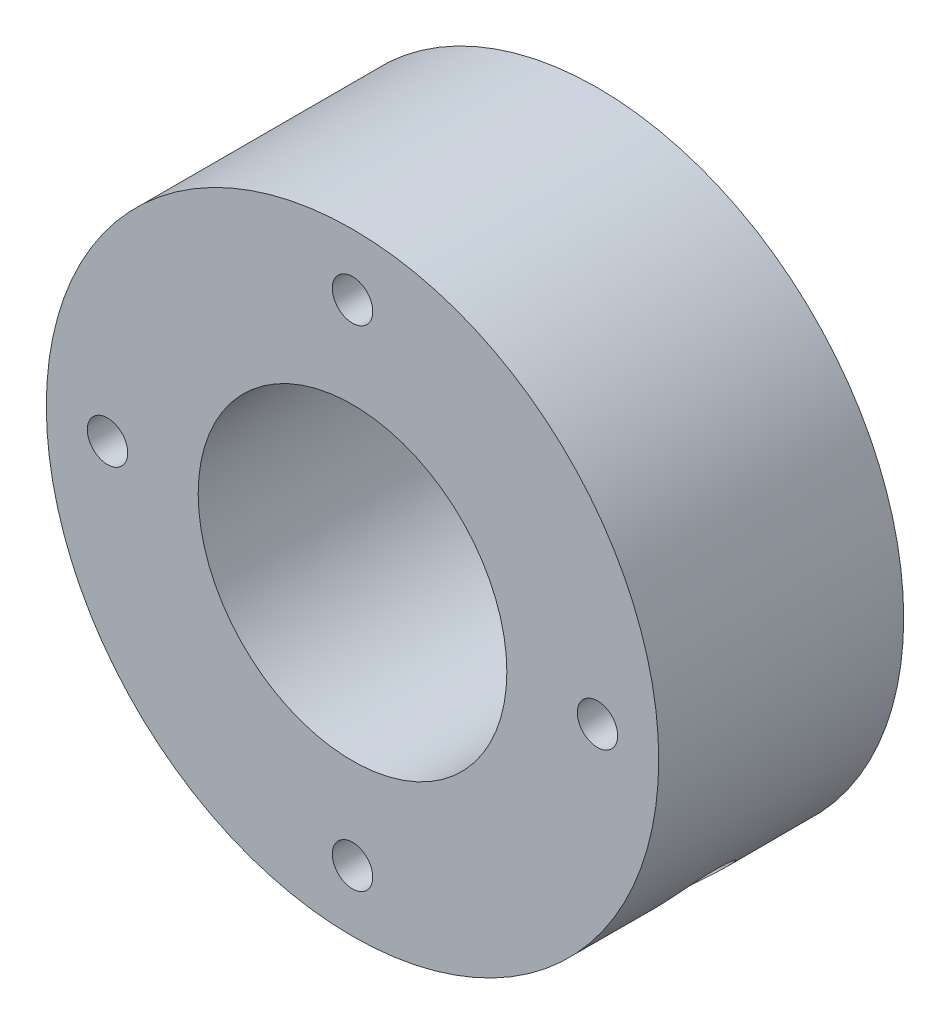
from build123d import *

# Parameters (mm, degrees)
SKETCH_1_R          = 25
SKETCH_1_R_2        = 12.6
EXTRUDE_1_DEPTH     = 20
SKETCH_2_R          = 1.65
CUT_EXTRUDE_1_DEPTH = 15
SKETCH_4_R          = 3
CUT_EXTRUDE_2_DEPTH = 15


with BuildPart() as part:
    # Sketch 1 → Extrude 1 (new body)
    with BuildSketch(Plane.XY):
        Circle(SKETCH_1_R)
        Circle(SKETCH_1_R_2, mode=Mode.SUBTRACT)
    extrude(amount=EXTRUDE_1_DEPTH)

    # Sketch 2 → Cut-Extrude 1 (cut)
    with BuildSketch(Plane.XY.offset(20)):
        with Locations((0, 20)):
            Circle(SKETCH_2_R)
        with Locations((20, 0)):
            Circle(SKETCH_2_R)
        with Locations((0, -20)):
            Circle(SKETCH_2_R)
        with Locations((-20, 0)):
            Circle(SKETCH_2_R)
    extrude(amount=-CUT_EXTRUDE_1_DEPTH, mode=Mode.SUBTRACT)

    # Sketch 4 → Cut-Extrude 2 (cut)
    with BuildSketch(Plane(origin=(17.67766953, -17.67766953, 0), x_dir=(0, 0, -1), z_dir=(0.7071067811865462, -0.7071067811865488, 0))):
        with Locations(Location((-10, 0, 0), (0, 0, 90))):
            Circle(SKETCH_4_R)
    extrude(amount=-CUT_EXTRUDE_2_DEPTH, mode=Mode.SUBTRACT)


solid = part.part
